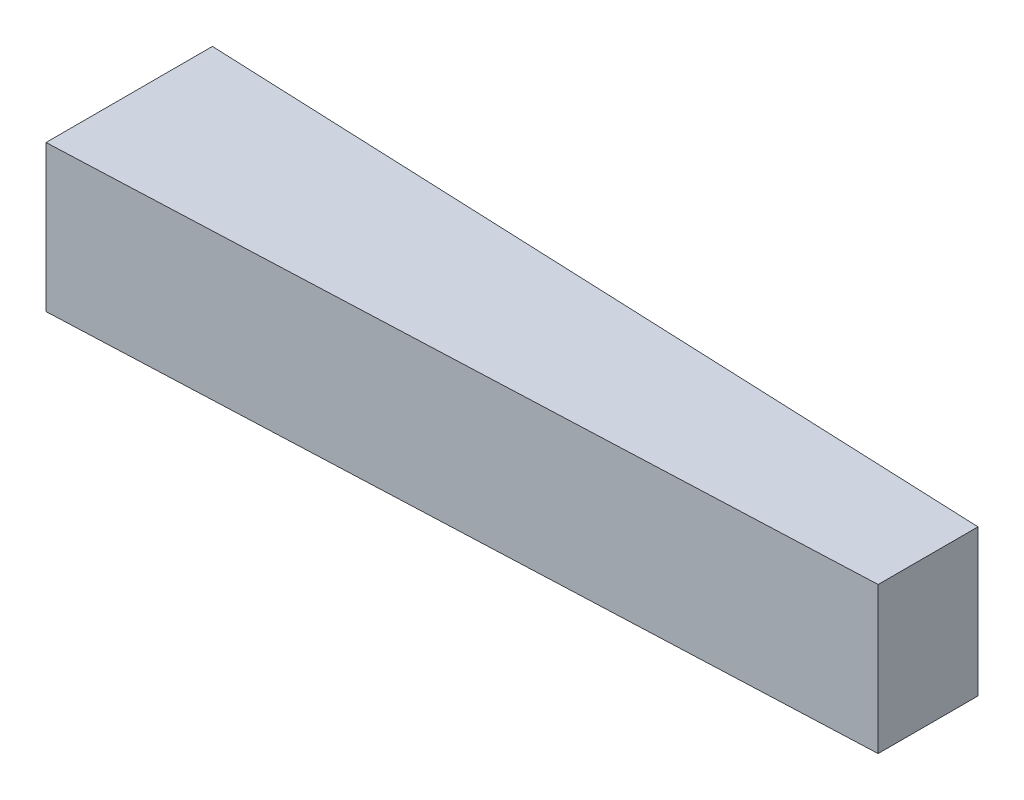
from build123d import *

# Parameters (mm, degrees)
EXTRUDE_1_DEPTH = 22
EXTRUDE_START   = -22
EXTRUDE_2_DEPTH = 10
EXTRUDE_START_2 = 22
EXTRUDE_3_DEPTH = 10


with BuildPart() as part:
    # Sketch 1 → Extrude 1 (new, symmetric)
    with BuildSketch(Plane(origin=(0, 0, 0), x_dir=(1, 0, 0), z_dir=(0, 1, 0))):
        Polygon((0, 25), (0, -25), (240, -15), (240, 15), align=None)
        Polygon((10, 14.574656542), (230, 5.407989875), (230, -5.407989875), (10, -14.574656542), align=None, mode=Mode.SUBTRACT)
    extrude(amount=EXTRUDE_1_DEPTH, both=True)

    # Sketch 1_2 → Extrude 2 (add)
    with BuildSketch(Plane(origin=(0, 0, 0), x_dir=(1, 0, 0), z_dir=(0, 1, 0)).offset(EXTRUDE_START)):
        Polygon((10, 14.574656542), (230, 5.407989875), (230, -5.407989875), (10, -14.574656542), align=None)
    extrude(amount=EXTRUDE_2_DEPTH)

    # Sketch 1_3 → Extrude 3 (add)
    with BuildSketch(Plane(origin=(0, 0, 0), x_dir=(1, 0, 0), z_dir=(0, 1, 0)).offset(EXTRUDE_START_2)):
        Polygon((10, 14.574656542), (230, 5.407989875), (230, -5.407989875), (10, -14.574656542), align=None)
        Polygon((230, 0), (10, 0), (10, -14.574656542), (230, -5.407989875), align=None)
    extrude(amount=-EXTRUDE_3_DEPTH)


solid = part.part
